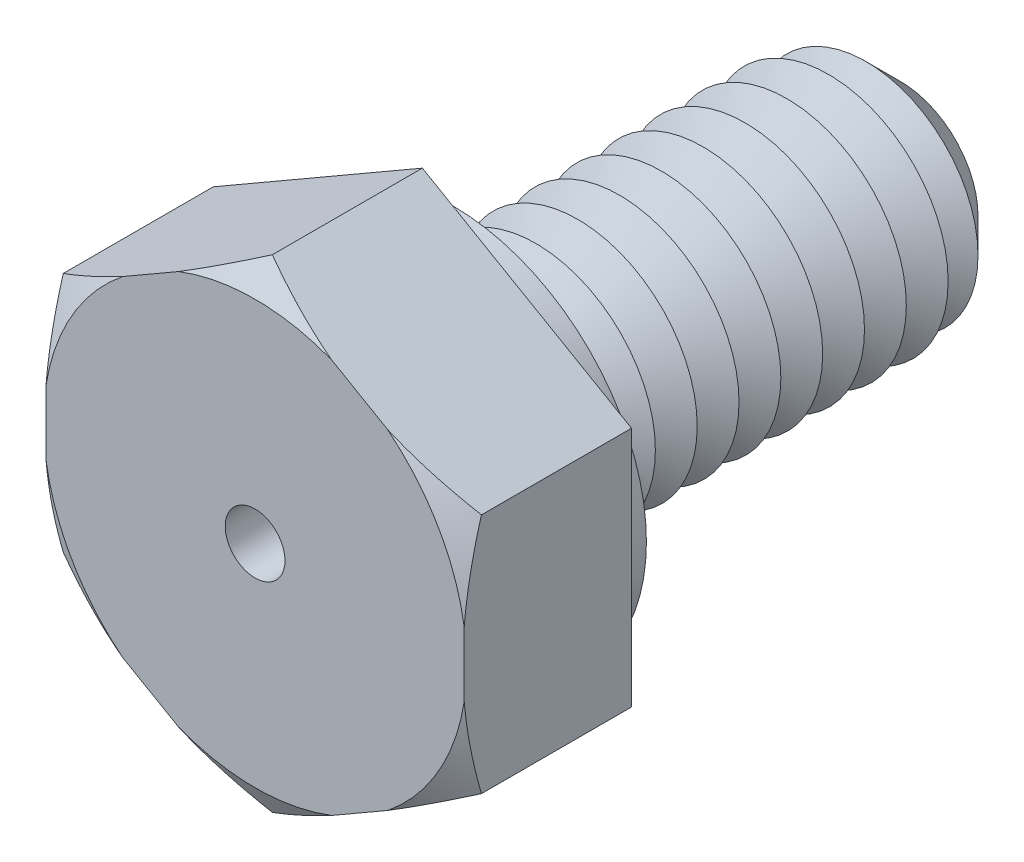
from build123d import *

# Parameters (mm, degrees)
BOSS_EXTRUDE1_DEPTH = 2.8
SKETCH3_R           = 2
BOSS_EXTRUDE2_DEPTH = 8
SKETCH4_R           = 3.25
BOSS_EXTRUDE3_DEPTH = 0.5
CHAMFER1_SIZE       = 0.7
LPATTERN1_COUNT     = 10
LPATTERN1_PITCH     = 0.7
SKETCH8_R           = 0.5
CUT_EXTRUDE1_DEPTH  = 10.8


with BuildPart() as part:
    # Sketch2 → Boss-Extrude1 (new body)
    with BuildSketch(Plane.XY):
        Polygon((0, 4.041451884), (-3.5, 2.020725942), (-3.5, -2.020725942), (0, -4.041451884), (3.5, -2.020725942), (3.5, 2.020725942), align=None)
    extrude(amount=BOSS_EXTRUDE1_DEPTH)

    # Sketch3 → Boss-Extrude2 (add)
    with BuildSketch(Plane(origin=(0, 0, 0), x_dir=(-1, 0, 0), z_dir=(0, 0, -1))):
        Circle(SKETCH3_R)
    extrude(amount=BOSS_EXTRUDE2_DEPTH)

    # Sketch4 → Boss-Extrude3 (add)
    with BuildSketch(Plane(origin=(0, 0, 0), x_dir=(-1, 0, 0), z_dir=(0, 0, -1))):
        with Locations(Location((0, 0, 0), (0, 0, 180))):
            Circle(SKETCH4_R)
    extrude(amount=BOSS_EXTRUDE3_DEPTH)

    # Chamfer1
    chamfer1_edges = [part.edges().sort_by_distance(p)[0] for p in [
        (2, 0, -8),
    ]]
    chamfer(chamfer1_edges, length=CHAMFER1_SIZE)

    # Sketch6 → Cut-Revolve1 (revolve, cut)
    with BuildSketch(Plane(origin=(0, 0, 0), x_dir=(0, 0, -1), z_dir=(1, 0, 0)), mode=Mode.PRIVATE) as cut_revolve1_sk:
        Polygon((0.5, 2), (0.85, 1.393782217), (1.2, 2), align=None)
    cut_revolve1 = revolve(cut_revolve1_sk.sketch.rotate(Axis((0, 0, 3.211670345), (0, 0, -1)), 90), axis=Axis((0, 0, 3.211670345), (0, 0, -1)), mode=Mode.SUBTRACT)

    # LPattern1: Cut-Revolve1 ×10
    with Locations(*[(0, 0, -i * LPATTERN1_PITCH) for i in range(1, LPATTERN1_COUNT)]):
        add(cut_revolve1, mode=Mode.SUBTRACT)

    # Sketch7 → Cut-Revolve2 (revolve, cut)
    with BuildSketch(Plane(origin=(0, 0, 0), x_dir=(0, 0, -1), z_dir=(1, 0, 0)), mode=Mode.PRIVATE) as cut_revolve2_sk:
        Polygon((-2.8, 4.041451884), (-2.8, 3.541451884), (-2.511324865, 4.041451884), align=None)
    revolve(cut_revolve2_sk.sketch.rotate(Axis((0, 0, 3.211670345), (0, 0, -1)), 90), axis=Axis((0, 0, 3.211670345), (0, 0, -1)), mode=Mode.SUBTRACT)

    # Sketch8 → Cut-Extrude1 (cut)
    with BuildSketch(Plane.XY.offset(2.8)):
        Circle(SKETCH8_R)
    extrude(amount=-CUT_EXTRUDE1_DEPTH, mode=Mode.SUBTRACT)


solid = part.part
